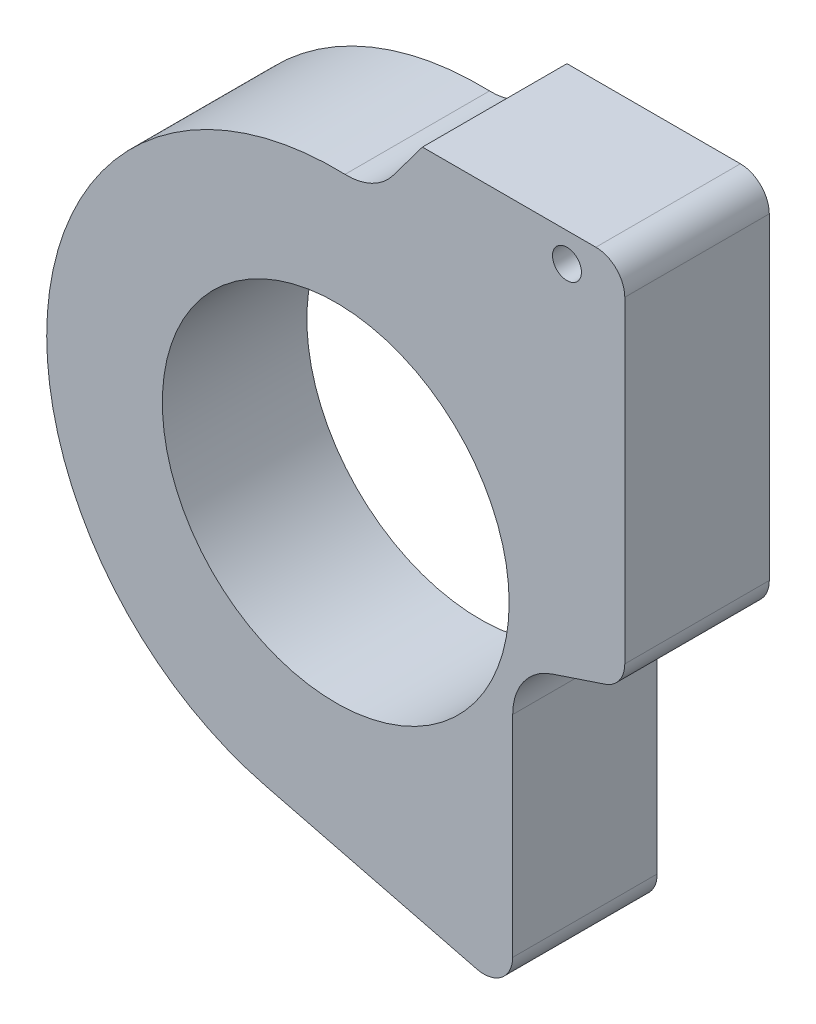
ISO-10303-21;
HEADER;
FILE_DESCRIPTION(('STEP AP214'),'2;1');
FILE_NAME('part.step','',(''),(''),'','','');
FILE_SCHEMA(('AUTOMOTIVE_DESIGN { 1 0 10303 214 1 1 1 1 }'));
ENDSEC;
DATA;
#1=APPLICATION_CONTEXT('core data for automotive mechanical design processes');
#2=APPLICATION_PROTOCOL_DEFINITION('international standard','automotive_design',2000,#1);
#3=PRODUCT_CONTEXT('',#1,'mechanical');
#4=PRODUCT('Part','Part','',(#3));
#5=PRODUCT_RELATED_PRODUCT_CATEGORY('part','',(#4));
#6=PRODUCT_DEFINITION_FORMATION('','',#4);
#7=PRODUCT_DEFINITION_CONTEXT('part definition',#1,'design');
#8=PRODUCT_DEFINITION('design','',#6,#7);
#9=PRODUCT_DEFINITION_SHAPE('','',#8);
#10=(LENGTH_UNIT() NAMED_UNIT(*) SI_UNIT(.MILLI.,.METRE.));
#11=(NAMED_UNIT(*) PLANE_ANGLE_UNIT() SI_UNIT($,.RADIAN.));
#12=(NAMED_UNIT(*) SI_UNIT($,.STERADIAN.) SOLID_ANGLE_UNIT());
#13=UNCERTAINTY_MEASURE_WITH_UNIT(LENGTH_MEASURE(1.E-05),#10,'distance_accuracy_value','');
#14=(GEOMETRIC_REPRESENTATION_CONTEXT(3) GLOBAL_UNCERTAINTY_ASSIGNED_CONTEXT((#13)) GLOBAL_UNIT_ASSIGNED_CONTEXT((#10,
#11,#12)) REPRESENTATION_CONTEXT('',''));
#15=CARTESIAN_POINT('',(0.,0.,0.));
#16=DIRECTION('',(0.,0.,1.));
#17=DIRECTION('',(1.,0.,0.));
#18=AXIS2_PLACEMENT_3D('',#15,#16,#17);
#19=CARTESIAN_POINT('',(0.,0.,-5.));
#20=DIRECTION('',(0.,0.,1.));
#21=DIRECTION('',(1.,0.,0.));
#22=AXIS2_PLACEMENT_3D('',#19,#20,#21);
#23=CYLINDRICAL_SURFACE('',#22,10.);
#24=CARTESIAN_POINT('',(0.,0.,0.));
#25=DIRECTION('',(0.,0.,1.));
#26=DIRECTION('',(1.,0.,0.));
#27=AXIS2_PLACEMENT_3D('',#24,#25,#26);
#28=CIRCLE('',#27,10.);
#29=CARTESIAN_POINT('',(0.321199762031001,9.99484020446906,0.));
#30=VERTEX_POINT('',#29);
#31=CARTESIAN_POINT('',(-2.43630372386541,-9.69868156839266,0.));
#32=VERTEX_POINT('',#31);
#33=EDGE_CURVE('E120',#30,#32,#28,.T.);
#34=ORIENTED_EDGE('',*,*,#33,.F.);
#35=DIRECTION('',(0.,0.,1.));
#36=VECTOR('',#35,1.);
#37=CARTESIAN_POINT('',(0.321199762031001,9.99484020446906,-5.));
#38=LINE('',#37,#36);
#39=CARTESIAN_POINT('',(0.321199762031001,9.99484020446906,-5.));
#40=VERTEX_POINT('',#39);
#41=EDGE_CURVE('E11',#40,#30,#38,.T.);
#42=ORIENTED_EDGE('',*,*,#41,.F.);
#43=CARTESIAN_POINT('',(0.,0.,-5.));
#44=DIRECTION('',(0.,0.,1.));
#45=DIRECTION('',(1.,0.,0.));
#46=AXIS2_PLACEMENT_3D('',#43,#44,#45);
#47=CIRCLE('',#46,10.);
#48=CARTESIAN_POINT('',(-2.43630372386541,-9.69868156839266,-5.));
#49=VERTEX_POINT('',#48);
#50=EDGE_CURVE('E122',#40,#49,#47,.T.);
#51=ORIENTED_EDGE('',*,*,#50,.T.);
#52=DIRECTION('',(0.,0.,1.));
#53=VECTOR('',#52,1.);
#54=CARTESIAN_POINT('',(-2.43630372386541,-9.69868156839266,-5.));
#55=LINE('',#54,#53);
#56=EDGE_CURVE('E35',#49,#32,#55,.T.);
#57=ORIENTED_EDGE('',*,*,#56,.T.);
#58=EDGE_LOOP('',(#34,#42,#51,#57));
#59=FACE_BOUND('',#58,.T.);
#60=ADVANCED_FACE('F32',(#59),#23,.T.);
#61=CARTESIAN_POINT('',(0.3854397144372,11.9938082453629,-5.));
#62=DIRECTION('',(0.,0.,1.));
#63=DIRECTION('',(1.,0.,0.));
#64=AXIS2_PLACEMENT_3D('',#61,#62,#63);
#65=CYLINDRICAL_SURFACE('',#64,2.);
#66=CARTESIAN_POINT('',(0.3854397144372,11.9938082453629,0.));
#67=DIRECTION('',(0.,0.,-1.));
#68=DIRECTION('',(-1.,0.,0.));
#69=AXIS2_PLACEMENT_3D('',#66,#67,#68);
#70=CIRCLE('',#69,2.);
#71=CARTESIAN_POINT('',(1.98754990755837,10.7966270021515,0.));
#72=VERTEX_POINT('',#71);
#73=EDGE_CURVE('E138',#72,#30,#70,.T.);
#74=ORIENTED_EDGE('',*,*,#73,.F.);
#75=DIRECTION('',(0.,0.,1.));
#76=VECTOR('',#75,1.);
#77=CARTESIAN_POINT('',(1.98754990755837,10.7966270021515,-5.));
#78=LINE('',#77,#76);
#79=CARTESIAN_POINT('',(1.98754990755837,10.7966270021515,-5.));
#80=VERTEX_POINT('',#79);
#81=EDGE_CURVE('E40',#80,#72,#78,.T.);
#82=ORIENTED_EDGE('',*,*,#81,.F.);
#83=CARTESIAN_POINT('',(0.3854397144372,11.9938082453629,-5.));
#84=DIRECTION('',(0.,0.,-1.));
#85=DIRECTION('',(-1.,0.,0.));
#86=AXIS2_PLACEMENT_3D('',#83,#84,#85);
#87=CIRCLE('',#86,2.);
#88=EDGE_CURVE('E127',#80,#40,#87,.T.);
#89=ORIENTED_EDGE('',*,*,#88,.T.);
#90=ORIENTED_EDGE('',*,*,#41,.T.);
#91=EDGE_LOOP('',(#74,#82,#89,#90));
#92=FACE_BOUND('',#91,.T.);
#93=ADVANCED_FACE('F250',(#92),#65,.F.);
#94=CARTESIAN_POINT('',(3.,12.1515234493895,-5.));
#95=DIRECTION('',(-0.801055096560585,0.598590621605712,0.));
#96=DIRECTION('',(-0.598590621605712,-0.801055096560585,0.));
#97=AXIS2_PLACEMENT_3D('',#94,#95,#96);
#98=PLANE('',#97);
#99=DIRECTION('',(-0.598590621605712,-0.801055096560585,0.));
#100=VECTOR('',#99,1.);
#101=CARTESIAN_POINT('',(3.,12.1515234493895,0.));
#102=LINE('',#101,#100);
#103=CARTESIAN_POINT('',(3.,12.1515234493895,0.));
#104=VERTEX_POINT('',#103);
#105=EDGE_CURVE('E168',#104,#72,#102,.T.);
#106=ORIENTED_EDGE('',*,*,#105,.F.);
#107=DIRECTION('',(0.,0.,1.));
#108=VECTOR('',#107,1.);
#109=CARTESIAN_POINT('',(3.,12.1515234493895,-5.));
#110=LINE('',#109,#108);
#111=CARTESIAN_POINT('',(3.,12.1515234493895,-5.));
#112=VERTEX_POINT('',#111);
#113=EDGE_CURVE('E202',#112,#104,#110,.T.);
#114=ORIENTED_EDGE('',*,*,#113,.F.);
#115=DIRECTION('',(-0.598590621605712,-0.801055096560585,0.));
#116=VECTOR('',#115,1.);
#117=CARTESIAN_POINT('',(3.,12.1515234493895,-5.));
#118=LINE('',#117,#116);
#119=EDGE_CURVE('E198',#112,#80,#118,.T.);
#120=ORIENTED_EDGE('',*,*,#119,.T.);
#121=ORIENTED_EDGE('',*,*,#81,.T.);
#122=EDGE_LOOP('',(#106,#114,#120,#121));
#123=FACE_BOUND('',#122,.T.);
#124=ADVANCED_FACE('F255',(#123),#98,.T.);
#125=CARTESIAN_POINT('',(9.,12.1515234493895,-5.));
#126=DIRECTION('',(0.,1.,0.));
#127=DIRECTION('',(-1.,0.,0.));
#128=AXIS2_PLACEMENT_3D('',#125,#126,#127);
#129=PLANE('',#128);
#130=DIRECTION('',(-1.,0.,0.));
#131=VECTOR('',#130,1.);
#132=CARTESIAN_POINT('',(9.,12.1515234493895,0.));
#133=LINE('',#132,#131);
#134=CARTESIAN_POINT('',(9.,12.1515234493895,0.));
#135=VERTEX_POINT('',#134);
#136=EDGE_CURVE('E165',#135,#104,#133,.T.);
#137=ORIENTED_EDGE('',*,*,#136,.F.);
#138=DIRECTION('',(0.,0.,1.));
#139=VECTOR('',#138,1.);
#140=CARTESIAN_POINT('',(9.,12.1515234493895,-5.));
#141=LINE('',#140,#139);
#142=CARTESIAN_POINT('',(9.,12.1515234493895,-5.));
#143=VERTEX_POINT('',#142);
#144=EDGE_CURVE('E204',#143,#135,#141,.T.);
#145=ORIENTED_EDGE('',*,*,#144,.F.);
#146=DIRECTION('',(-1.,0.,0.));
#147=VECTOR('',#146,1.);
#148=CARTESIAN_POINT('',(9.,12.1515234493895,-5.));
#149=LINE('',#148,#147);
#150=EDGE_CURVE('E195',#143,#112,#149,.T.);
#151=ORIENTED_EDGE('',*,*,#150,.T.);
#152=ORIENTED_EDGE('',*,*,#113,.T.);
#153=EDGE_LOOP('',(#137,#145,#151,#152));
#154=FACE_BOUND('',#153,.T.);
#155=ADVANCED_FACE('F247',(#154),#129,.T.);
#156=CARTESIAN_POINT('',(9.,11.1515234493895,-5.));
#157=DIRECTION('',(0.,0.,1.));
#158=DIRECTION('',(1.,0.,0.));
#159=AXIS2_PLACEMENT_3D('',#156,#157,#158);
#160=CYLINDRICAL_SURFACE('',#159,1.);
#161=CARTESIAN_POINT('',(9.,11.1515234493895,0.));
#162=DIRECTION('',(0.,0.,1.));
#163=DIRECTION('',(1.,0.,0.));
#164=AXIS2_PLACEMENT_3D('',#161,#162,#163);
#165=CIRCLE('',#164,1.);
#166=CARTESIAN_POINT('',(10.,11.1515234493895,0.));
#167=VERTEX_POINT('',#166);
#168=EDGE_CURVE('E162',#167,#135,#165,.T.);
#169=ORIENTED_EDGE('',*,*,#168,.F.);
#170=DIRECTION('',(0.,0.,1.));
#171=VECTOR('',#170,1.);
#172=CARTESIAN_POINT('',(10.,11.1515234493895,-5.));
#173=LINE('',#172,#171);
#174=CARTESIAN_POINT('',(10.,11.1515234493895,-5.));
#175=VERTEX_POINT('',#174);
#176=EDGE_CURVE('E206',#175,#167,#173,.T.);
#177=ORIENTED_EDGE('',*,*,#176,.F.);
#178=CARTESIAN_POINT('',(9.,11.1515234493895,-5.));
#179=DIRECTION('',(0.,0.,1.));
#180=DIRECTION('',(1.,0.,0.));
#181=AXIS2_PLACEMENT_3D('',#178,#179,#180);
#182=CIRCLE('',#181,1.);
#183=EDGE_CURVE('E192',#175,#143,#182,.T.);
#184=ORIENTED_EDGE('',*,*,#183,.T.);
#185=ORIENTED_EDGE('',*,*,#144,.T.);
#186=EDGE_LOOP('',(#169,#177,#184,#185));
#187=FACE_BOUND('',#186,.T.);
#188=ADVANCED_FACE('F243',(#187),#160,.T.);
#189=CARTESIAN_POINT('',(10.,0.16569187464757,-5.));
#190=DIRECTION('',(1.,0.,0.));
#191=DIRECTION('',(0.,0.,-1.));
#192=AXIS2_PLACEMENT_3D('',#189,#190,#191);
#193=PLANE('',#192);
#194=DIRECTION('',(0.,1.,0.));
#195=VECTOR('',#194,1.);
#196=CARTESIAN_POINT('',(10.,0.16569187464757,0.));
#197=LINE('',#196,#195);
#198=CARTESIAN_POINT('',(10.,0.16569187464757,0.));
#199=VERTEX_POINT('',#198);
#200=EDGE_CURVE('E159',#199,#167,#197,.T.);
#201=ORIENTED_EDGE('',*,*,#200,.F.);
#202=DIRECTION('',(0.,0.,1.));
#203=VECTOR('',#202,1.);
#204=CARTESIAN_POINT('',(10.,0.16569187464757,-5.));
#205=LINE('',#204,#203);
#206=CARTESIAN_POINT('',(10.,0.16569187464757,-5.));
#207=VERTEX_POINT('',#206);
#208=EDGE_CURVE('E208',#207,#199,#205,.T.);
#209=ORIENTED_EDGE('',*,*,#208,.F.);
#210=DIRECTION('',(0.,1.,0.));
#211=VECTOR('',#210,1.);
#212=CARTESIAN_POINT('',(10.,0.16569187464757,-5.));
#213=LINE('',#212,#211);
#214=EDGE_CURVE('E189',#207,#175,#213,.T.);
#215=ORIENTED_EDGE('',*,*,#214,.T.);
#216=ORIENTED_EDGE('',*,*,#176,.T.);
#217=EDGE_LOOP('',(#201,#209,#215,#216));
#218=FACE_BOUND('',#217,.T.);
#219=ADVANCED_FACE('F239',(#218),#193,.T.);
#220=CARTESIAN_POINT('',(9.,0.16569187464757,-5.));
#221=DIRECTION('',(0.,0.,1.));
#222=DIRECTION('',(1.,0.,0.));
#223=AXIS2_PLACEMENT_3D('',#220,#221,#222);
#224=CYLINDRICAL_SURFACE('',#223,0.999999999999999);
#225=CARTESIAN_POINT('',(9.,0.16569187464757,0.));
#226=DIRECTION('',(0.,0.,1.));
#227=DIRECTION('',(-1.,0.,0.));
#228=AXIS2_PLACEMENT_3D('',#225,#226,#227);
#229=CIRCLE('',#228,0.999999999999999);
#230=CARTESIAN_POINT('',(9.31646259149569,-0.782913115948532,0.));
#231=VERTEX_POINT('',#230);
#232=EDGE_CURVE('E156',#231,#199,#229,.T.);
#233=ORIENTED_EDGE('',*,*,#232,.F.);
#234=DIRECTION('',(0.,0.,1.));
#235=VECTOR('',#234,1.);
#236=CARTESIAN_POINT('',(9.31646259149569,-0.782913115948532,-5.));
#237=LINE('',#236,#235);
#238=CARTESIAN_POINT('',(9.31646259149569,-0.782913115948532,-5.));
#239=VERTEX_POINT('',#238);
#240=EDGE_CURVE('E210',#239,#231,#237,.T.);
#241=ORIENTED_EDGE('',*,*,#240,.F.);
#242=CARTESIAN_POINT('',(9.,0.16569187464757,-5.));
#243=DIRECTION('',(0.,0.,1.));
#244=DIRECTION('',(-1.,0.,0.));
#245=AXIS2_PLACEMENT_3D('',#242,#243,#244);
#246=CIRCLE('',#245,0.999999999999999);
#247=EDGE_CURVE('E186',#239,#207,#246,.T.);
#248=ORIENTED_EDGE('',*,*,#247,.T.);
#249=ORIENTED_EDGE('',*,*,#208,.T.);
#250=EDGE_LOOP('',(#233,#241,#248,#249));
#251=FACE_BOUND('',#250,.T.);
#252=ADVANCED_FACE('F235',(#251),#224,.T.);
#253=CARTESIAN_POINT('',(7.48889000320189,-1.39260667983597,-5.));
#254=DIRECTION('',(0.316462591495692,-0.948604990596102,0.));
#255=DIRECTION('',(0.948604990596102,0.316462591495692,0.));
#256=AXIS2_PLACEMENT_3D('',#253,#254,#255);
#257=PLANE('',#256);
#258=DIRECTION('',(0.948604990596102,0.316462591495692,0.));
#259=VECTOR('',#258,1.);
#260=CARTESIAN_POINT('',(7.48889000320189,-1.39260667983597,0.));
#261=LINE('',#260,#259);
#262=CARTESIAN_POINT('',(7.48889000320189,-1.39260667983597,0.));
#263=VERTEX_POINT('',#262);
#264=EDGE_CURVE('E153',#263,#231,#261,.T.);
#265=ORIENTED_EDGE('',*,*,#264,.F.);
#266=DIRECTION('',(0.,0.,1.));
#267=VECTOR('',#266,1.);
#268=CARTESIAN_POINT('',(7.48889000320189,-1.39260667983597,-5.));
#269=LINE('',#268,#267);
#270=CARTESIAN_POINT('',(7.48889000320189,-1.39260667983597,-5.));
#271=VERTEX_POINT('',#270);
#272=EDGE_CURVE('E212',#271,#263,#269,.T.);
#273=ORIENTED_EDGE('',*,*,#272,.F.);
#274=DIRECTION('',(0.948604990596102,0.316462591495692,0.));
#275=VECTOR('',#274,1.);
#276=CARTESIAN_POINT('',(7.48889000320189,-1.39260667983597,-5.));
#277=LINE('',#276,#275);
#278=EDGE_CURVE('E183',#271,#239,#277,.T.);
#279=ORIENTED_EDGE('',*,*,#278,.T.);
#280=ORIENTED_EDGE('',*,*,#240,.T.);
#281=EDGE_LOOP('',(#265,#273,#279,#280));
#282=FACE_BOUND('',#281,.T.);
#283=ADVANCED_FACE('F231',(#282),#257,.T.);
#284=CARTESIAN_POINT('',(8.12181518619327,-3.28981666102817,-5.));
#285=DIRECTION('',(0.,0.,1.));
#286=DIRECTION('',(1.,0.,0.));
#287=AXIS2_PLACEMENT_3D('',#284,#285,#286);
#288=CYLINDRICAL_SURFACE('',#287,2.);
#289=CARTESIAN_POINT('',(8.12181518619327,-3.28981666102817,0.));
#290=DIRECTION('',(0.,0.,-1.));
#291=DIRECTION('',(-1.,0.,0.));
#292=AXIS2_PLACEMENT_3D('',#289,#290,#291);
#293=CIRCLE('',#292,2.);
#294=CARTESIAN_POINT('',(6.12181518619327,-3.28981666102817,0.));
#295=VERTEX_POINT('',#294);
#296=EDGE_CURVE('E150',#295,#263,#293,.T.);
#297=ORIENTED_EDGE('',*,*,#296,.F.);
#298=DIRECTION('',(0.,0.,1.));
#299=VECTOR('',#298,1.);
#300=CARTESIAN_POINT('',(6.12181518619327,-3.28981666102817,-5.));
#301=LINE('',#300,#299);
#302=CARTESIAN_POINT('',(6.12181518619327,-3.28981666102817,-5.));
#303=VERTEX_POINT('',#302);
#304=EDGE_CURVE('E214',#303,#295,#301,.T.);
#305=ORIENTED_EDGE('',*,*,#304,.F.);
#306=CARTESIAN_POINT('',(8.12181518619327,-3.28981666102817,-5.));
#307=DIRECTION('',(0.,0.,-1.));
#308=DIRECTION('',(-1.,0.,0.));
#309=AXIS2_PLACEMENT_3D('',#306,#307,#308);
#310=CIRCLE('',#309,2.);
#311=EDGE_CURVE('E180',#303,#271,#310,.T.);
#312=ORIENTED_EDGE('',*,*,#311,.T.);
#313=ORIENTED_EDGE('',*,*,#272,.T.);
#314=EDGE_LOOP('',(#297,#305,#312,#313));
#315=FACE_BOUND('',#314,.T.);
#316=ADVANCED_FACE('F227',(#315),#288,.F.);
#317=CARTESIAN_POINT('',(6.12181518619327,-3.28981666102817,-5.));
#318=DIRECTION('',(1.,0.,0.));
#319=DIRECTION('',(0.,0.,-1.));
#320=AXIS2_PLACEMENT_3D('',#317,#318,#319);
#321=PLANE('',#320);
#322=DIRECTION('',(0.,1.,0.));
#323=VECTOR('',#322,1.);
#324=CARTESIAN_POINT('',(6.12181518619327,-3.28981666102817,0.));
#325=LINE('',#324,#323);
#326=CARTESIAN_POINT('',(6.12181518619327,-10.5662090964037,0.));
#327=VERTEX_POINT('',#326);
#328=EDGE_CURVE('E147',#327,#295,#325,.T.);
#329=ORIENTED_EDGE('',*,*,#328,.F.);
#330=DIRECTION('',(0.,0.,1.));
#331=VECTOR('',#330,1.);
#332=CARTESIAN_POINT('',(6.12181518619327,-10.5662090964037,-5.));
#333=LINE('',#332,#331);
#334=CARTESIAN_POINT('',(6.12181518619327,-10.5662090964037,-5.));
#335=VERTEX_POINT('',#334);
#336=EDGE_CURVE('E216',#335,#327,#333,.T.);
#337=ORIENTED_EDGE('',*,*,#336,.F.);
#338=DIRECTION('',(0.,1.,0.));
#339=VECTOR('',#338,1.);
#340=CARTESIAN_POINT('',(6.12181518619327,-3.28981666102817,-5.));
#341=LINE('',#340,#339);
#342=EDGE_CURVE('E177',#335,#303,#341,.T.);
#343=ORIENTED_EDGE('',*,*,#342,.T.);
#344=ORIENTED_EDGE('',*,*,#304,.T.);
#345=EDGE_LOOP('',(#329,#337,#343,#344));
#346=FACE_BOUND('',#345,.T.);
#347=ADVANCED_FACE('F223',(#346),#321,.T.);
#348=CARTESIAN_POINT('',(5.12181518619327,-10.5662090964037,-5.));
#349=DIRECTION('',(0.,0.,1.));
#350=DIRECTION('',(1.,0.,0.));
#351=AXIS2_PLACEMENT_3D('',#348,#349,#350);
#352=CYLINDRICAL_SURFACE('',#351,1.);
#353=CARTESIAN_POINT('',(5.12181518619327,-10.5662090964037,0.));
#354=DIRECTION('',(0.,0.,1.));
#355=DIRECTION('',(1.,0.,0.));
#356=AXIS2_PLACEMENT_3D('',#353,#354,#355);
#357=CIRCLE('',#356,1.);
#358=CARTESIAN_POINT('',(4.87818481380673,-11.5360772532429,0.));
#359=VERTEX_POINT('',#358);
#360=EDGE_CURVE('E134',#359,#327,#357,.T.);
#361=ORIENTED_EDGE('',*,*,#360,.F.);
#362=DIRECTION('',(0.,0.,1.));
#363=VECTOR('',#362,1.);
#364=CARTESIAN_POINT('',(4.87818481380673,-11.5360772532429,-5.));
#365=LINE('',#364,#363);
#366=CARTESIAN_POINT('',(4.87818481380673,-11.5360772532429,-5.));
#367=VERTEX_POINT('',#366);
#368=EDGE_CURVE('E126',#367,#359,#365,.T.);
#369=ORIENTED_EDGE('',*,*,#368,.F.);
#370=CARTESIAN_POINT('',(5.12181518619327,-10.5662090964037,-5.));
#371=DIRECTION('',(0.,0.,1.));
#372=DIRECTION('',(1.,0.,0.));
#373=AXIS2_PLACEMENT_3D('',#370,#371,#372);
#374=CIRCLE('',#373,1.);
#375=EDGE_CURVE('E174',#367,#335,#374,.T.);
#376=ORIENTED_EDGE('',*,*,#375,.T.);
#377=ORIENTED_EDGE('',*,*,#336,.T.);
#378=EDGE_LOOP('',(#361,#369,#376,#377));
#379=FACE_BOUND('',#378,.T.);
#380=ADVANCED_FACE('F219',(#379),#352,.T.);
#381=CARTESIAN_POINT('',(-2.43630372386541,-9.69868156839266,-5.));
#382=DIRECTION('',(-0.243630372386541,-0.969868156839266,0.));
#383=DIRECTION('',(0.969868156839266,-0.243630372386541,0.));
#384=AXIS2_PLACEMENT_3D('',#381,#382,#383);
#385=PLANE('',#384);
#386=DIRECTION('',(0.969868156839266,-0.243630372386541,0.));
#387=VECTOR('',#386,1.);
#388=CARTESIAN_POINT('',(-2.43630372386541,-9.69868156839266,0.));
#389=LINE('',#388,#387);
#390=EDGE_CURVE('E129',#32,#359,#389,.T.);
#391=ORIENTED_EDGE('',*,*,#390,.F.);
#392=ORIENTED_EDGE('',*,*,#56,.F.);
#393=DIRECTION('',(0.969868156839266,-0.243630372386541,0.));
#394=VECTOR('',#393,1.);
#395=CARTESIAN_POINT('',(-2.43630372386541,-9.69868156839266,-5.));
#396=LINE('',#395,#394);
#397=EDGE_CURVE('E172',#49,#367,#396,.T.);
#398=ORIENTED_EDGE('',*,*,#397,.T.);
#399=ORIENTED_EDGE('',*,*,#368,.T.);
#400=EDGE_LOOP('',(#391,#392,#398,#399));
#401=FACE_BOUND('',#400,.T.);
#402=ADVANCED_FACE('F130',(#401),#385,.T.);
#403=CARTESIAN_POINT('',(0.,0.,-5.));
#404=DIRECTION('',(0.,0.,1.));
#405=DIRECTION('',(1.,0.,0.));
#406=AXIS2_PLACEMENT_3D('',#403,#404,#405);
#407=PLANE('',#406);
#408=CARTESIAN_POINT('',(8.,11.1515234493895,-5.));
#409=DIRECTION('',(0.,0.,1.));
#410=DIRECTION('',(1.,0.,0.));
#411=AXIS2_PLACEMENT_3D('',#408,#409,#410);
#412=CIRCLE('',#411,0.500000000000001);
#413=CARTESIAN_POINT('',(8.5,11.1515234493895,-5.));
#414=VERTEX_POINT('',#413);
#415=EDGE_CURVE('E389',#414,#414,#412,.T.);
#416=ORIENTED_EDGE('',*,*,#415,.T.);
#417=EDGE_LOOP('',(#416));
#418=FACE_BOUND('',#417,.T.);
#419=CARTESIAN_POINT('',(0.,0.,-5.));
#420=DIRECTION('',(0.,0.,1.));
#421=DIRECTION('',(1.,0.,0.));
#422=AXIS2_PLACEMENT_3D('',#419,#420,#421);
#423=CIRCLE('',#422,6.);
#424=CARTESIAN_POINT('',(6.,0.,-5.));
#425=VERTEX_POINT('',#424);
#426=EDGE_CURVE('E139',#425,#425,#423,.T.);
#427=ORIENTED_EDGE('',*,*,#426,.T.);
#428=EDGE_LOOP('',(#427));
#429=FACE_BOUND('',#428,.T.);
#430=ORIENTED_EDGE('',*,*,#50,.F.);
#431=ORIENTED_EDGE('',*,*,#88,.F.);
#432=ORIENTED_EDGE('',*,*,#119,.F.);
#433=ORIENTED_EDGE('',*,*,#150,.F.);
#434=ORIENTED_EDGE('',*,*,#183,.F.);
#435=ORIENTED_EDGE('',*,*,#214,.F.);
#436=ORIENTED_EDGE('',*,*,#247,.F.);
#437=ORIENTED_EDGE('',*,*,#278,.F.);
#438=ORIENTED_EDGE('',*,*,#311,.F.);
#439=ORIENTED_EDGE('',*,*,#342,.F.);
#440=ORIENTED_EDGE('',*,*,#375,.F.);
#441=ORIENTED_EDGE('',*,*,#397,.F.);
#442=EDGE_LOOP('',(#430,#431,#432,#433,#434,#435,#436,#437,#438,#439,#440,#441));
#443=FACE_BOUND('',#442,.T.);
#444=ADVANCED_FACE('F254',(#418,#429,#443),#407,.F.);
#445=CARTESIAN_POINT('',(0.,0.,0.));
#446=DIRECTION('',(0.,0.,1.));
#447=DIRECTION('',(1.,0.,0.));
#448=AXIS2_PLACEMENT_3D('',#445,#446,#447);
#449=PLANE('',#448);
#450=CARTESIAN_POINT('',(8.,11.1515234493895,0.));
#451=DIRECTION('',(0.,0.,1.));
#452=DIRECTION('',(1.,0.,0.));
#453=AXIS2_PLACEMENT_3D('',#450,#451,#452);
#454=CIRCLE('',#453,0.500000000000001);
#455=CARTESIAN_POINT('',(8.5,11.1515234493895,0.));
#456=VERTEX_POINT('',#455);
#457=EDGE_CURVE('E392',#456,#456,#454,.T.);
#458=ORIENTED_EDGE('',*,*,#457,.F.);
#459=EDGE_LOOP('',(#458));
#460=FACE_BOUND('',#459,.T.);
#461=CARTESIAN_POINT('',(0.,0.,0.));
#462=DIRECTION('',(0.,0.,1.));
#463=DIRECTION('',(1.,0.,0.));
#464=AXIS2_PLACEMENT_3D('',#461,#462,#463);
#465=CIRCLE('',#464,6.);
#466=CARTESIAN_POINT('',(6.,0.,0.));
#467=VERTEX_POINT('',#466);
#468=EDGE_CURVE('E142',#467,#467,#465,.T.);
#469=ORIENTED_EDGE('',*,*,#468,.F.);
#470=EDGE_LOOP('',(#469));
#471=FACE_BOUND('',#470,.T.);
#472=ORIENTED_EDGE('',*,*,#33,.T.);
#473=ORIENTED_EDGE('',*,*,#390,.T.);
#474=ORIENTED_EDGE('',*,*,#360,.T.);
#475=ORIENTED_EDGE('',*,*,#328,.T.);
#476=ORIENTED_EDGE('',*,*,#296,.T.);
#477=ORIENTED_EDGE('',*,*,#264,.T.);
#478=ORIENTED_EDGE('',*,*,#232,.T.);
#479=ORIENTED_EDGE('',*,*,#200,.T.);
#480=ORIENTED_EDGE('',*,*,#168,.T.);
#481=ORIENTED_EDGE('',*,*,#136,.T.);
#482=ORIENTED_EDGE('',*,*,#105,.T.);
#483=ORIENTED_EDGE('',*,*,#73,.T.);
#484=EDGE_LOOP('',(#472,#473,#474,#475,#476,#477,#478,#479,#480,#481,#482,#483));
#485=FACE_BOUND('',#484,.T.);
#486=ADVANCED_FACE('F136',(#460,#471,#485),#449,.T.);
#487=CARTESIAN_POINT('',(0.,0.,-5.));
#488=DIRECTION('',(0.,0.,1.));
#489=DIRECTION('',(1.,0.,0.));
#490=AXIS2_PLACEMENT_3D('',#487,#488,#489);
#491=CYLINDRICAL_SURFACE('',#490,6.);
#492=ORIENTED_EDGE('',*,*,#426,.F.);
#493=EDGE_LOOP('',(#492));
#494=FACE_BOUND('',#493,.T.);
#495=ORIENTED_EDGE('',*,*,#468,.T.);
#496=EDGE_LOOP('',(#495));
#497=FACE_BOUND('',#496,.T.);
#498=ADVANCED_FACE('F362',(#494,#497),#491,.F.);
#499=CARTESIAN_POINT('',(8.,11.1515234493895,-5.));
#500=DIRECTION('',(0.,0.,1.));
#501=DIRECTION('',(1.,0.,0.));
#502=AXIS2_PLACEMENT_3D('',#499,#500,#501);
#503=CYLINDRICAL_SURFACE('',#502,0.500000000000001);
#504=ORIENTED_EDGE('',*,*,#415,.F.);
#505=EDGE_LOOP('',(#504));
#506=FACE_BOUND('',#505,.T.);
#507=ORIENTED_EDGE('',*,*,#457,.T.);
#508=EDGE_LOOP('',(#507));
#509=FACE_BOUND('',#508,.T.);
#510=ADVANCED_FACE('F372',(#506,#509),#503,.F.);
#511=CLOSED_SHELL('',(#60,#93,#124,#155,#188,#219,#252,#283,#316,#347,#380,#402,#444,#486,#498,#510));
#512=MANIFOLD_SOLID_BREP('B2',#511);
#513=ADVANCED_BREP_SHAPE_REPRESENTATION('',(#18,#512),#14);
#514=SHAPE_DEFINITION_REPRESENTATION(#9,#513);
ENDSEC;
END-ISO-10303-21;
